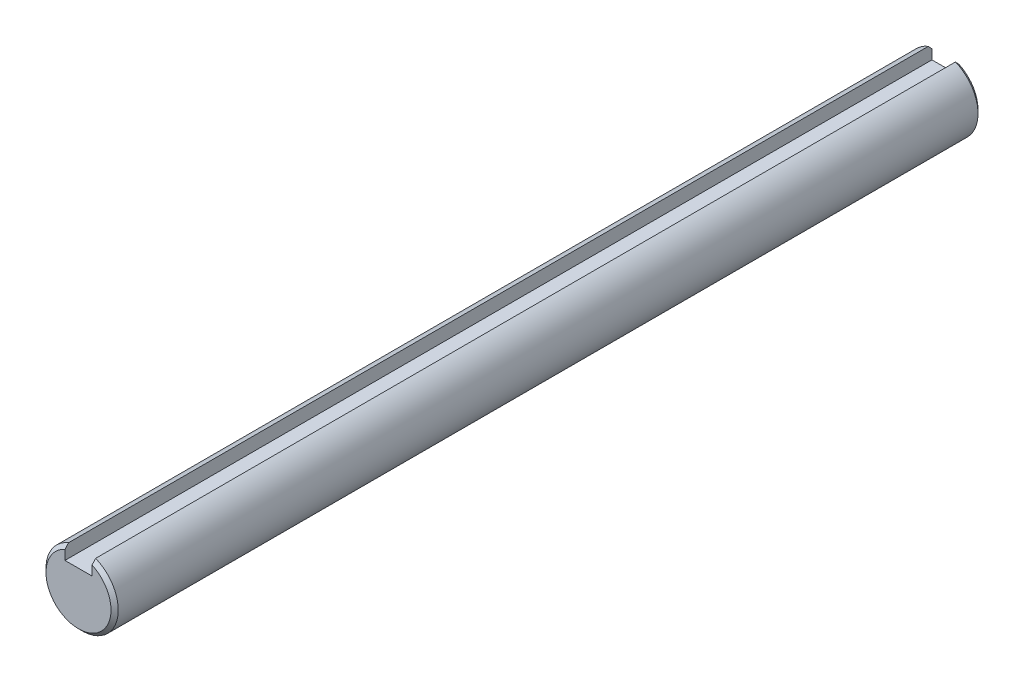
from build123d import *

# Parameters (mm, degrees)
BOSS_EXTRUDE2_DEPTH      = 38.1
BOSS_EXTRUDE2_DEPTH_BACK = 38.1
SKETCH3_R                = 3.175
CUT_EXTRUDE5_DEPTH       = 39.363670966
CUT_EXTRUDE5_DEPTH_BACK  = 39.363670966
SKETCH10_W               = 2.38125
SKETCH10_H               = 1.422321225
CHAMFER1_SIZE            = 0.3175


with BuildPart() as part:
    # Sketch3 → Boss-Extrude2 (new, two sides: drawn at the far end of the back side and taken through both)
    with BuildSketch(Plane.XY.offset(-BOSS_EXTRUDE2_DEPTH_BACK)):
        with Locations(Location((0, 0, 0), (0, 0, 180))):
            Circle(SKETCH3_R)
    extrude(amount=BOSS_EXTRUDE2_DEPTH + BOSS_EXTRUDE2_DEPTH_BACK)

    # Sketch10 → Cut-Extrude5 (cut, two sides: drawn at the far end of the back side and taken through both)
    with BuildSketch(Plane.XY.offset(-CUT_EXTRUDE5_DEPTH_BACK)):
        with Locations((0, 2.463839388)):
            Rectangle(SKETCH10_W, SKETCH10_H)
    extrude(amount=CUT_EXTRUDE5_DEPTH + CUT_EXTRUDE5_DEPTH_BACK, mode=Mode.SUBTRACT)

    # Chamfer1
    chamfer1_edges = [part.edges().sort_by_distance(p)[0] for p in [
        (0, -3.175, 38.1),
        (0, -3.175, -38.1),
    ]]
    chamfer(chamfer1_edges, length=CHAMFER1_SIZE)


solid = part.part
